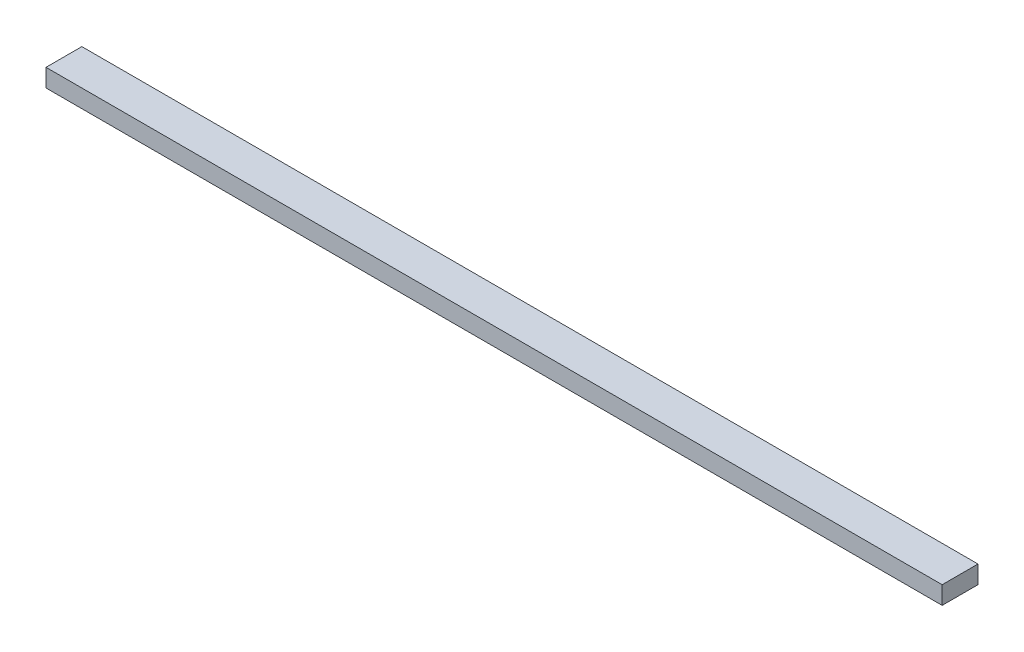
ISO-10303-21;
HEADER;
FILE_DESCRIPTION(('STEP AP214'),'2;1');
FILE_NAME('part.step','',(''),(''),'','','');
FILE_SCHEMA(('AUTOMOTIVE_DESIGN { 1 0 10303 214 1 1 1 1 }'));
ENDSEC;
DATA;
#1=APPLICATION_CONTEXT('core data for automotive mechanical design processes');
#2=APPLICATION_PROTOCOL_DEFINITION('international standard','automotive_design',2000,#1);
#3=PRODUCT_CONTEXT('',#1,'mechanical');
#4=PRODUCT('Part','Part','',(#3));
#5=PRODUCT_RELATED_PRODUCT_CATEGORY('part','',(#4));
#6=PRODUCT_DEFINITION_FORMATION('','',#4);
#7=PRODUCT_DEFINITION_CONTEXT('part definition',#1,'design');
#8=PRODUCT_DEFINITION('design','',#6,#7);
#9=PRODUCT_DEFINITION_SHAPE('','',#8);
#10=(LENGTH_UNIT() NAMED_UNIT(*) SI_UNIT(.MILLI.,.METRE.));
#11=(NAMED_UNIT(*) PLANE_ANGLE_UNIT() SI_UNIT($,.RADIAN.));
#12=(NAMED_UNIT(*) SI_UNIT($,.STERADIAN.) SOLID_ANGLE_UNIT());
#13=UNCERTAINTY_MEASURE_WITH_UNIT(LENGTH_MEASURE(1.E-05),#10,'distance_accuracy_value','');
#14=(GEOMETRIC_REPRESENTATION_CONTEXT(3) GLOBAL_UNCERTAINTY_ASSIGNED_CONTEXT((#13)) GLOBAL_UNIT_ASSIGNED_CONTEXT((#10,
#11,#12)) REPRESENTATION_CONTEXT('',''));
#15=CARTESIAN_POINT('',(0.,0.,0.));
#16=DIRECTION('',(0.,0.,1.));
#17=DIRECTION('',(1.,0.,0.));
#18=AXIS2_PLACEMENT_3D('',#15,#16,#17);
#19=CARTESIAN_POINT('',(0.,5.,0.));
#20=DIRECTION('',(1.,0.,0.));
#21=DIRECTION('',(0.,0.,-1.));
#22=AXIS2_PLACEMENT_3D('',#19,#20,#21);
#23=PLANE('',#22);
#24=DIRECTION('',(0.,0.,1.));
#25=VECTOR('',#24,1.);
#26=CARTESIAN_POINT('',(0.,0.,0.));
#27=LINE('',#26,#25);
#28=CARTESIAN_POINT('',(0.,0.,-10.));
#29=VERTEX_POINT('',#28);
#30=CARTESIAN_POINT('',(0.,0.,0.));
#31=VERTEX_POINT('',#30);
#32=EDGE_CURVE('E70',#29,#31,#27,.T.);
#33=ORIENTED_EDGE('',*,*,#32,.T.);
#34=DIRECTION('',(0.,-1.,0.));
#35=VECTOR('',#34,1.);
#36=CARTESIAN_POINT('',(0.,5.,0.));
#37=LINE('',#36,#35);
#38=CARTESIAN_POINT('',(0.,5.,0.));
#39=VERTEX_POINT('',#38);
#40=EDGE_CURVE('E11',#39,#31,#37,.T.);
#41=ORIENTED_EDGE('',*,*,#40,.F.);
#42=DIRECTION('',(0.,0.,1.));
#43=VECTOR('',#42,1.);
#44=CARTESIAN_POINT('',(0.,5.,0.));
#45=LINE('',#44,#43);
#46=CARTESIAN_POINT('',(0.,5.,-10.));
#47=VERTEX_POINT('',#46);
#48=EDGE_CURVE('E88',#47,#39,#45,.T.);
#49=ORIENTED_EDGE('',*,*,#48,.F.);
#50=DIRECTION('',(0.,-1.,0.));
#51=VECTOR('',#50,1.);
#52=CARTESIAN_POINT('',(0.,5.,-10.));
#53=LINE('',#52,#51);
#54=EDGE_CURVE('E82',#47,#29,#53,.T.);
#55=ORIENTED_EDGE('',*,*,#54,.T.);
#56=EDGE_LOOP('',(#33,#41,#49,#55));
#57=FACE_BOUND('',#56,.T.);
#58=ADVANCED_FACE('F26',(#57),#23,.F.);
#59=CARTESIAN_POINT('',(0.,5.,0.));
#60=DIRECTION('',(0.,0.,-1.));
#61=DIRECTION('',(-1.,0.,0.));
#62=AXIS2_PLACEMENT_3D('',#59,#60,#61);
#63=PLANE('',#62);
#64=DIRECTION('',(1.,0.,0.));
#65=VECTOR('',#64,1.);
#66=CARTESIAN_POINT('',(0.,0.,0.));
#67=LINE('',#66,#65);
#68=CARTESIAN_POINT('',(250.,0.,0.));
#69=VERTEX_POINT('',#68);
#70=EDGE_CURVE('E66',#31,#69,#67,.T.);
#71=ORIENTED_EDGE('',*,*,#70,.T.);
#72=DIRECTION('',(0.,-1.,0.));
#73=VECTOR('',#72,1.);
#74=CARTESIAN_POINT('',(250.,5.,0.));
#75=LINE('',#74,#73);
#76=CARTESIAN_POINT('',(250.,5.,0.));
#77=VERTEX_POINT('',#76);
#78=EDGE_CURVE('E33',#77,#69,#75,.T.);
#79=ORIENTED_EDGE('',*,*,#78,.F.);
#80=DIRECTION('',(1.,0.,0.));
#81=VECTOR('',#80,1.);
#82=CARTESIAN_POINT('',(0.,5.,0.));
#83=LINE('',#82,#81);
#84=EDGE_CURVE('E78',#39,#77,#83,.T.);
#85=ORIENTED_EDGE('',*,*,#84,.F.);
#86=ORIENTED_EDGE('',*,*,#40,.T.);
#87=EDGE_LOOP('',(#71,#79,#85,#86));
#88=FACE_BOUND('',#87,.T.);
#89=ADVANCED_FACE('F77',(#88),#63,.F.);
#90=CARTESIAN_POINT('',(250.,5.,0.));
#91=DIRECTION('',(-1.,0.,0.));
#92=DIRECTION('',(0.,0.,1.));
#93=AXIS2_PLACEMENT_3D('',#90,#91,#92);
#94=PLANE('',#93);
#95=DIRECTION('',(0.,0.,-1.));
#96=VECTOR('',#95,1.);
#97=CARTESIAN_POINT('',(250.,0.,0.));
#98=LINE('',#97,#96);
#99=CARTESIAN_POINT('',(250.,0.,-10.));
#100=VERTEX_POINT('',#99);
#101=EDGE_CURVE('E71',#69,#100,#98,.T.);
#102=ORIENTED_EDGE('',*,*,#101,.T.);
#103=DIRECTION('',(0.,-1.,0.));
#104=VECTOR('',#103,1.);
#105=CARTESIAN_POINT('',(250.,5.,-10.));
#106=LINE('',#105,#104);
#107=CARTESIAN_POINT('',(250.,5.,-10.));
#108=VERTEX_POINT('',#107);
#109=EDGE_CURVE('E94',#108,#100,#106,.T.);
#110=ORIENTED_EDGE('',*,*,#109,.F.);
#111=DIRECTION('',(0.,0.,-1.));
#112=VECTOR('',#111,1.);
#113=CARTESIAN_POINT('',(250.,5.,0.));
#114=LINE('',#113,#112);
#115=EDGE_CURVE('E45',#77,#108,#114,.T.);
#116=ORIENTED_EDGE('',*,*,#115,.F.);
#117=ORIENTED_EDGE('',*,*,#78,.T.);
#118=EDGE_LOOP('',(#102,#110,#116,#117));
#119=FACE_BOUND('',#118,.T.);
#120=ADVANCED_FACE('F97',(#119),#94,.F.);
#121=CARTESIAN_POINT('',(0.,5.,-10.));
#122=DIRECTION('',(0.,0.,1.));
#123=DIRECTION('',(1.,0.,0.));
#124=AXIS2_PLACEMENT_3D('',#121,#122,#123);
#125=PLANE('',#124);
#126=DIRECTION('',(-1.,0.,0.));
#127=VECTOR('',#126,1.);
#128=CARTESIAN_POINT('',(0.,0.,-10.));
#129=LINE('',#128,#127);
#130=EDGE_CURVE('E86',#100,#29,#129,.T.);
#131=ORIENTED_EDGE('',*,*,#130,.T.);
#132=ORIENTED_EDGE('',*,*,#54,.F.);
#133=DIRECTION('',(-1.,0.,0.));
#134=VECTOR('',#133,1.);
#135=CARTESIAN_POINT('',(0.,5.,-10.));
#136=LINE('',#135,#134);
#137=EDGE_CURVE('E40',#108,#47,#136,.T.);
#138=ORIENTED_EDGE('',*,*,#137,.F.);
#139=ORIENTED_EDGE('',*,*,#109,.T.);
#140=EDGE_LOOP('',(#131,#132,#138,#139));
#141=FACE_BOUND('',#140,.T.);
#142=ADVANCED_FACE('F99',(#141),#125,.F.);
#143=CARTESIAN_POINT('',(0.,5.,-10.));
#144=DIRECTION('',(0.,-1.,0.));
#145=DIRECTION('',(0.,0.,-1.));
#146=AXIS2_PLACEMENT_3D('',#143,#144,#145);
#147=PLANE('',#146);
#148=ORIENTED_EDGE('',*,*,#48,.T.);
#149=ORIENTED_EDGE('',*,*,#84,.T.);
#150=ORIENTED_EDGE('',*,*,#115,.T.);
#151=ORIENTED_EDGE('',*,*,#137,.T.);
#152=EDGE_LOOP('',(#148,#149,#150,#151));
#153=FACE_BOUND('',#152,.T.);
#154=ADVANCED_FACE('F100',(#153),#147,.F.);
#155=CARTESIAN_POINT('',(0.,0.,-10.));
#156=DIRECTION('',(0.,-1.,0.));
#157=DIRECTION('',(0.,0.,-1.));
#158=AXIS2_PLACEMENT_3D('',#155,#156,#157);
#159=PLANE('',#158);
#160=ORIENTED_EDGE('',*,*,#32,.F.);
#161=ORIENTED_EDGE('',*,*,#130,.F.);
#162=ORIENTED_EDGE('',*,*,#101,.F.);
#163=ORIENTED_EDGE('',*,*,#70,.F.);
#164=EDGE_LOOP('',(#160,#161,#162,#163));
#165=FACE_BOUND('',#164,.T.);
#166=ADVANCED_FACE('F67',(#165),#159,.T.);
#167=CLOSED_SHELL('',(#58,#89,#120,#142,#154,#166));
#168=MANIFOLD_SOLID_BREP('B2',#167);
#169=ADVANCED_BREP_SHAPE_REPRESENTATION('',(#18,#168),#14);
#170=SHAPE_DEFINITION_REPRESENTATION(#9,#169);
ENDSEC;
END-ISO-10303-21;
